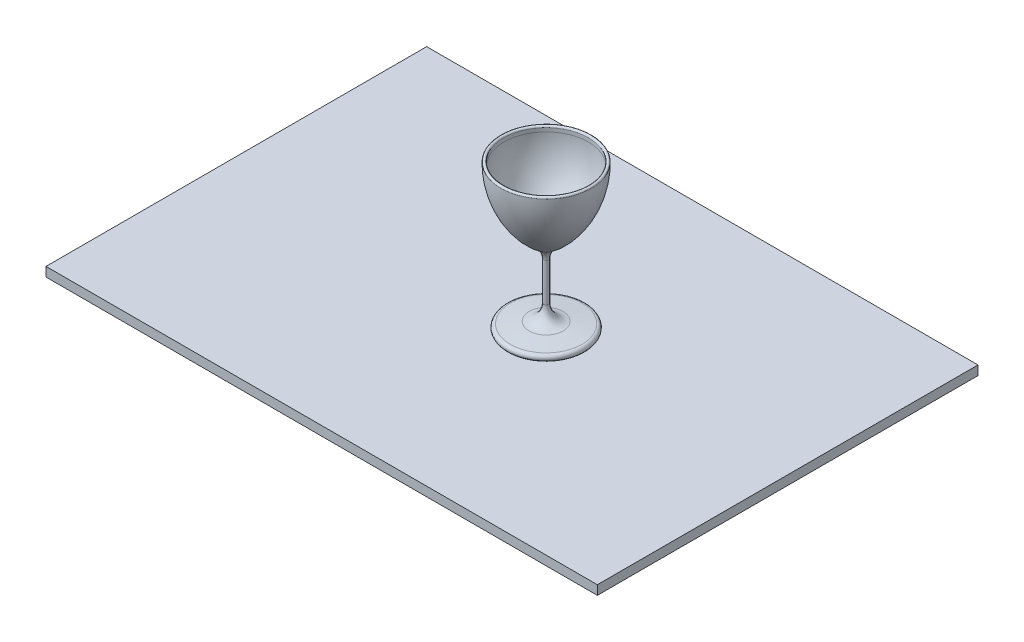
from build123d import *

# Parameters (mm, degrees)
SKETCH2_W           = 596.463797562
SKETCH2_H           = 411.817406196
BOSS_EXTRUDE1_DEPTH = 10


with BuildPart() as part:
    # Sketch1 → Revolve1 (revolve)
    with BuildSketch(Plane.XY, mode=Mode.PRIVATE) as revolve1_sk:
        with BuildLine():
            Line((0, 0), (38.747477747, 0))
            ThreePointArc((38.747477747, 0), (42.26831297, 3.520835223), (38.747477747, 7.041670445))
            Line((38.747477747, 7.041670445), (18.332808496, 9.354833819))
            ThreePointArc((18.332808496, 9.354833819), (7.281893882, 15.070466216), (2.846808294, 26.694629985))
            Line((2.846808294, 26.694629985), (2.846808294, 68.342849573))
            ThreePointArc((2.846808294, 68.342849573), (4.460777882, 75.019315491), (8.946245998, 80.221302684))
            ThreePointArc((8.946245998, 80.221302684), (38.462135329, 114.452128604), (49.082598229, 158.385520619))
            ThreePointArc((49.082598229, 158.385520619), (47.38788192, 160.080236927), (45.693165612, 158.385520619))
            Line((45.693165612, 158.385520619), (45.693165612, 154.423811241))
            ThreePointArc((45.693165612, 154.423811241), (33.353992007, 110.852199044), (0, 80.221302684))
            Line((0, 80.221302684), (0, 0))
        make_face()
    revolve(revolve1_sk.sketch.rotate(Axis((0, 0, 0), (0, 1, 0)), 90), axis=Axis((0, 0, 0), (0, 1, 0)))


with BuildPart() as body_2:
    # Sketch2 → Boss-Extrude1 (new body)
    with BuildSketch(Plane(origin=(0, 0, 0), x_dir=(1, 0, 0), z_dir=(0, 1, 0))):
        with Locations((-33.012536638, -3.916741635)):
            Rectangle(SKETCH2_W, SKETCH2_H)
    extrude(amount=-BOSS_EXTRUDE1_DEPTH)


solid = Compound([part.part, body_2.part])
